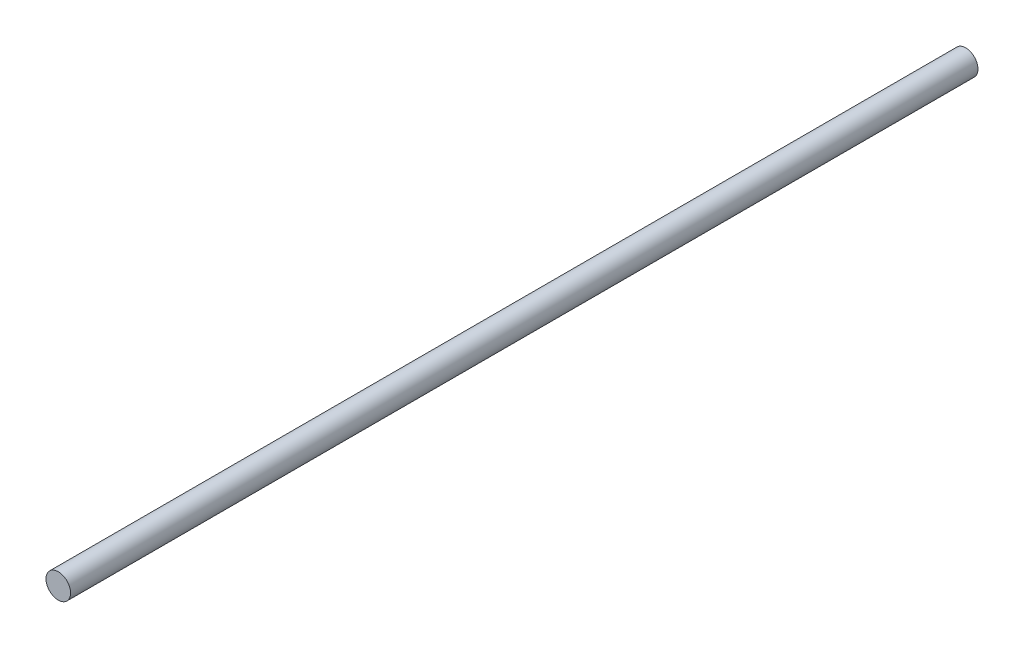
from build123d import *

# Parameters (mm, degrees)
EXTRUDE1_DEPTH      = 147.5
EXTRUDE1_DEPTH_BACK = 147.5
SKETCH1_R           = 4


with BuildPart() as part:
    # Sketch1 → Extrude1 (new, two sides: drawn at the far end of the back side and taken through both)
    with BuildSketch(Plane.XY.offset(-EXTRUDE1_DEPTH_BACK)):
        Circle(SKETCH1_R)
    extrude(amount=EXTRUDE1_DEPTH + EXTRUDE1_DEPTH_BACK)


solid = part.part
